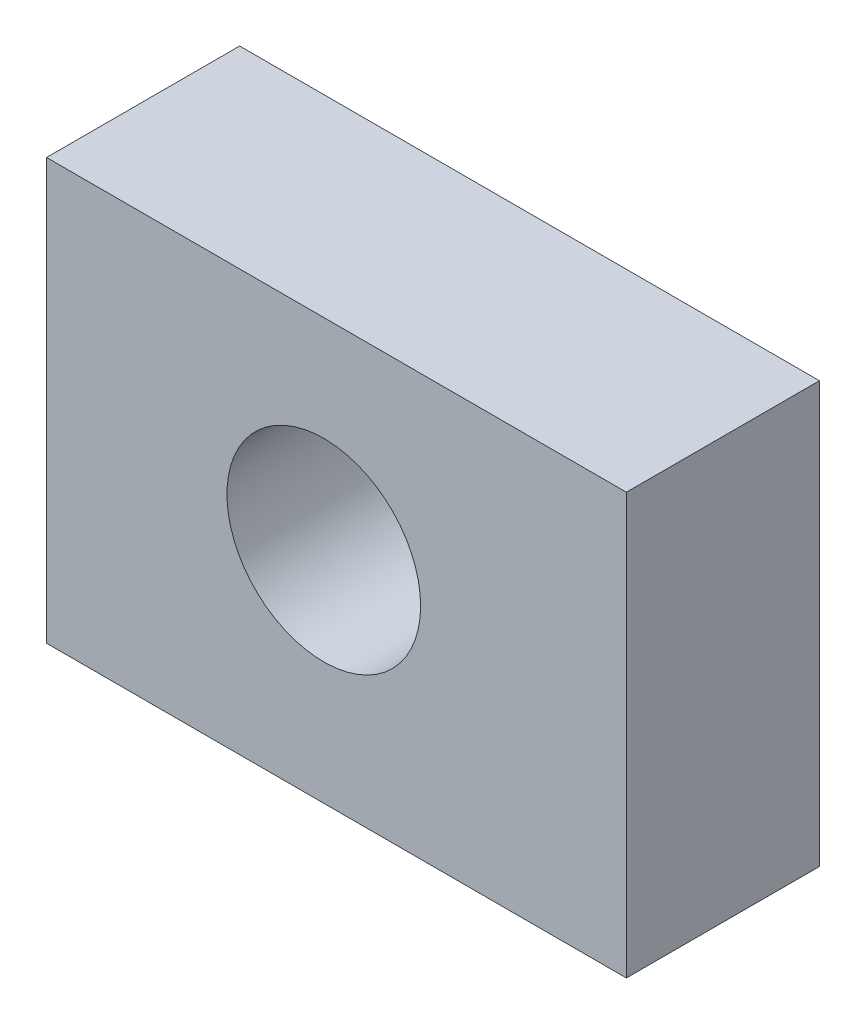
from build123d import *

# Parameters (mm, degrees)
SKETCH1_W          = 49.580976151
SKETCH1_H          = 35.977990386
EXTRUDE1_DEPTH     = 16.51
SKETCH2_R          = 8.280215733
CUT_EXTRUDE1_DEPTH = 64.44500838


with BuildPart() as part:
    # Sketch1 → Extrude1 (new body)
    with BuildSketch(Plane.XY):
        with Locations((24.790488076, 17.988995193)):
            Rectangle(SKETCH1_W, SKETCH1_H)
    extrude(amount=EXTRUDE1_DEPTH)

    # Sketch2 → Cut-Extrude1 (cut, through all)
    with BuildSketch(Plane.XY.offset(16.51)):
        with Locations((23.705672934, 18.751105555)):
            Circle(SKETCH2_R)
    extrude(amount=-CUT_EXTRUDE1_DEPTH, mode=Mode.SUBTRACT)


solid = part.part
